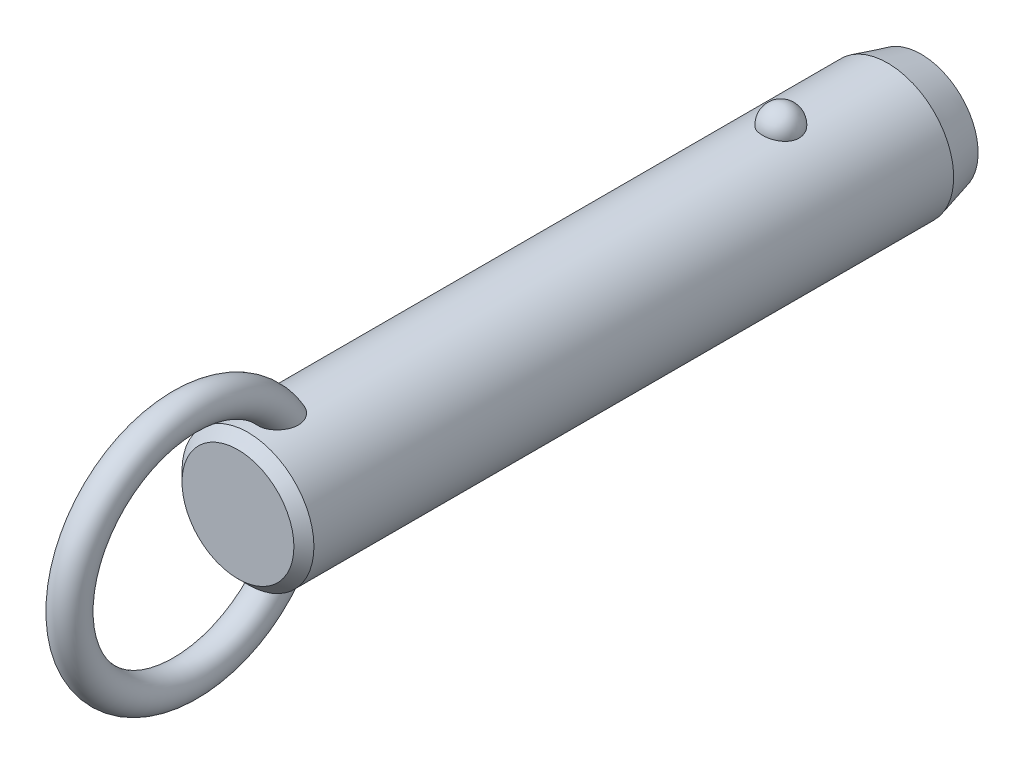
ISO-10303-21;
HEADER;
FILE_DESCRIPTION(('STEP AP214'),'2;1');
FILE_NAME('part.step','',(''),(''),'','','');
FILE_SCHEMA(('AUTOMOTIVE_DESIGN { 1 0 10303 214 1 1 1 1 }'));
ENDSEC;
DATA;
#1=APPLICATION_CONTEXT('core data for automotive mechanical design processes');
#2=APPLICATION_PROTOCOL_DEFINITION('international standard','automotive_design',2000,#1);
#3=PRODUCT_CONTEXT('',#1,'mechanical');
#4=PRODUCT('Part','Part','',(#3));
#5=PRODUCT_RELATED_PRODUCT_CATEGORY('part','',(#4));
#6=PRODUCT_DEFINITION_FORMATION('','',#4);
#7=PRODUCT_DEFINITION_CONTEXT('part definition',#1,'design');
#8=PRODUCT_DEFINITION('design','',#6,#7);
#9=PRODUCT_DEFINITION_SHAPE('','',#8);
#10=(LENGTH_UNIT() NAMED_UNIT(*) SI_UNIT(.MILLI.,.METRE.));
#11=(NAMED_UNIT(*) PLANE_ANGLE_UNIT() SI_UNIT($,.RADIAN.));
#12=(NAMED_UNIT(*) SI_UNIT($,.STERADIAN.) SOLID_ANGLE_UNIT());
#13=UNCERTAINTY_MEASURE_WITH_UNIT(LENGTH_MEASURE(1.E-05),#10,'distance_accuracy_value','');
#14=(GEOMETRIC_REPRESENTATION_CONTEXT(3) GLOBAL_UNCERTAINTY_ASSIGNED_CONTEXT((#13)) GLOBAL_UNIT_ASSIGNED_CONTEXT((#10,
#11,#12)) REPRESENTATION_CONTEXT('',''));
#15=CARTESIAN_POINT('',(0.,0.,0.));
#16=DIRECTION('',(0.,0.,1.));
#17=DIRECTION('',(1.,0.,0.));
#18=AXIS2_PLACEMENT_3D('',#15,#16,#17);
#19=CARTESIAN_POINT('',(0.,0.,53.3));
#20=DIRECTION('',(0.,0.,-1.));
#21=DIRECTION('',(-1.,0.,0.));
#22=AXIS2_PLACEMENT_3D('',#19,#20,#21);
#23=CYLINDRICAL_SURFACE('',#22,7.9);
#24=CARTESIAN_POINT('',(2.1785689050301,7.59367088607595,-2.2));
#25=CARTESIAN_POINT('',(2.17856679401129,7.59367269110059,-2.07701843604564));
#26=CARTESIAN_POINT('',(2.16853481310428,7.59657145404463,-1.95401006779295));
#27=CARTESIAN_POINT('',(2.12864689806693,7.607843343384,-1.71147811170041));
#28=CARTESIAN_POINT('',(2.09878338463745,7.61621856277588,-1.59195587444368));
#29=CARTESIAN_POINT('',(2.0199931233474,7.63749180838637,-1.35985638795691));
#30=CARTESIAN_POINT('',(1.97107475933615,7.6503878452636,-1.24727610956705));
#31=CARTESIAN_POINT('',(1.85539377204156,7.67926115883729,-1.03213234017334));
#32=CARTESIAN_POINT('',(1.78863158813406,7.69523835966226,-0.9295686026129));
#33=CARTESIAN_POINT('',(1.63856494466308,7.7285848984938,-0.736786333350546));
#34=CARTESIAN_POINT('',(1.55518140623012,7.7459606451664,-0.646630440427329));
#35=CARTESIAN_POINT('',(1.37422937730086,7.78009978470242,-0.481747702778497));
#36=CARTESIAN_POINT('',(1.27666086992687,7.79686317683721,-0.4070208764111));
#37=CARTESIAN_POINT('',(1.07024728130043,7.82786153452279,-0.275278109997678));
#38=CARTESIAN_POINT('',(0.961434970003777,7.84210353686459,-0.218212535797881));
#39=CARTESIAN_POINT('',(0.735351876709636,7.86652194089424,-0.123146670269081));
#40=CARTESIAN_POINT('',(0.618082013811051,7.87669878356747,-0.0851443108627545));
#41=CARTESIAN_POINT('',(0.380637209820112,7.89170521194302,-0.0298158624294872));
#42=CARTESIAN_POINT('',(0.260550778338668,7.89662650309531,-0.0121347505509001));
#43=CARTESIAN_POINT('',(0.0190117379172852,7.90090003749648,0.00324379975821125));
#44=CARTESIAN_POINT('',(-0.102440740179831,7.90025280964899,0.000943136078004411));
#45=CARTESIAN_POINT('',(-0.341452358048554,7.89351056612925,-0.0233955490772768));
#46=CARTESIAN_POINT('',(-0.459042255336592,7.88749257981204,-0.0451545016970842));
#47=CARTESIAN_POINT('',(-0.688796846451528,7.87075812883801,-0.107408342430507));
#48=CARTESIAN_POINT('',(-0.800961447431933,7.86004158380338,-0.147903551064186));
#49=CARTESIAN_POINT('',(-1.01743634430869,7.83497131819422,-0.246799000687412));
#50=CARTESIAN_POINT('',(-1.12169791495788,7.82059709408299,-0.305300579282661));
#51=CARTESIAN_POINT('',(-1.31891765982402,7.78976470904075,-0.438549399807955));
#52=CARTESIAN_POINT('',(-1.41187469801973,7.77330633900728,-0.513298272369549));
#53=CARTESIAN_POINT('',(-1.58577142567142,7.73972434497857,-0.678622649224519));
#54=CARTESIAN_POINT('',(-1.66645140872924,7.72259402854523,-0.769470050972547));
#55=CARTESIAN_POINT('',(-1.81161503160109,7.68983776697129,-0.963538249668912));
#56=CARTESIAN_POINT('',(-1.87609753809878,7.6742119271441,-1.06675991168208));
#57=CARTESIAN_POINT('',(-1.98790138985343,7.6460202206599,-1.28401170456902));
#58=CARTESIAN_POINT('',(-2.03501994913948,7.63349104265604,-1.39815107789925));
#59=CARTESIAN_POINT('',(-2.10986724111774,7.6131449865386,-1.63301784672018));
#60=CARTESIAN_POINT('',(-2.1375965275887,7.60532797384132,-1.75374505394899));
#61=CARTESIAN_POINT('',(-2.17289256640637,7.5953195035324,-1.99782562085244));
#62=CARTESIAN_POINT('',(-2.18054294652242,7.59310471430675,-2.12116592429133));
#63=CARTESIAN_POINT('',(-2.17572919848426,7.59448538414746,-2.36741799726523));
#64=CARTESIAN_POINT('',(-2.1632656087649,7.59808068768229,-2.49032977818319));
#65=CARTESIAN_POINT('',(-2.11865035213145,7.61064035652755,-2.73161015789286));
#66=CARTESIAN_POINT('',(-2.08659579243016,7.61957823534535,-2.84999812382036));
#67=CARTESIAN_POINT('',(-2.00367799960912,7.64179982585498,-3.07955956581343));
#68=CARTESIAN_POINT('',(-1.9528140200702,7.65508371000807,-3.19073275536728));
#69=CARTESIAN_POINT('',(-1.83321113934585,7.68460381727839,-3.40337899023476));
#70=CARTESIAN_POINT('',(-1.76437735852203,7.70085556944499,-3.50479651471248));
#71=CARTESIAN_POINT('',(-1.61069526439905,7.73445734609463,-3.69446912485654));
#72=CARTESIAN_POINT('',(-1.52584634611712,7.75180741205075,-3.78272371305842));
#73=CARTESIAN_POINT('',(-1.34198059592,7.78574608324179,-3.94393987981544));
#74=CARTESIAN_POINT('',(-1.24291308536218,7.80233167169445,-4.01684434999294));
#75=CARTESIAN_POINT('',(-1.03352039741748,7.83281625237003,-4.14489386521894));
#76=CARTESIAN_POINT('',(-0.92319600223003,7.84671543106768,-4.20004014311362));
#77=CARTESIAN_POINT('',(-0.695822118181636,7.87011575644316,-4.29042017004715));
#78=CARTESIAN_POINT('',(-0.578872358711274,7.87966903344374,-4.32589112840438));
#79=CARTESIAN_POINT('',(-0.340410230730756,7.8935652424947,-4.37692226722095));
#80=CARTESIAN_POINT('',(-0.218898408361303,7.89790879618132,-4.39248482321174));
#81=CARTESIAN_POINT('',(0.0228107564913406,7.90087453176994,-4.40314405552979));
#82=CARTESIAN_POINT('',(0.142990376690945,7.89960185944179,-4.39861683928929));
#83=CARTESIAN_POINT('',(0.380829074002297,7.89171262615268,-4.37008293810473));
#84=CARTESIAN_POINT('',(0.498488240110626,7.8850962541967,-4.34607694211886));
#85=CARTESIAN_POINT('',(0.727535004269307,7.86726442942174,-4.27939317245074));
#86=CARTESIAN_POINT('',(0.838944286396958,7.85606616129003,-4.23678512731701));
#87=CARTESIAN_POINT('',(1.05295421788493,7.83025654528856,-4.13408348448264));
#88=CARTESIAN_POINT('',(1.15555431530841,7.81564498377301,-4.07398879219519));
#89=CARTESIAN_POINT('',(1.35076763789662,7.7843022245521,-3.93687432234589));
#90=CARTESIAN_POINT('',(1.4432046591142,7.76754209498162,-3.85961036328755));
#91=CARTESIAN_POINT('',(1.6139111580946,7.73387857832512,-3.69076949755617));
#92=CARTESIAN_POINT('',(1.6921781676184,7.71697516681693,-3.59919010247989));
#93=CARTESIAN_POINT('',(1.83380875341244,7.6845643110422,-3.40247278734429));
#94=CARTESIAN_POINT('',(1.89689280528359,7.66908588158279,-3.29712873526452));
#95=CARTESIAN_POINT('',(2.0047823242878,7.64159441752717,-3.07707931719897));
#96=CARTESIAN_POINT('',(2.0495945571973,7.62958010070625,-2.96237743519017));
#97=CARTESIAN_POINT('',(2.11580183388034,7.61146617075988,-2.74040519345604));
#98=CARTESIAN_POINT('',(2.13929812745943,7.60484503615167,-2.63379846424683));
#99=CARTESIAN_POINT('',(2.17068242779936,7.59594664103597,-2.41813481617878));
#100=CARTESIAN_POINT('',(2.17857077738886,7.59366928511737,-2.30907795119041));
#101=CARTESIAN_POINT('',(2.1785689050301,7.59367088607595,-2.2));
#102=B_SPLINE_CURVE_WITH_KNOTS('',3,(#24,#25,#26,#27,#28,#29,#30,#31,#32,#33,#34,#35,#36,#37,
#38,#39,#40,#41,#42,#43,#44,#45,#46,#47,#48,#49,#50,#51,#52,#53,#54,#55,#56,#57,#58,#59,#60,#61,
#62,#63,#64,#65,#66,#67,#68,#69,#70,#71,#72,#73,#74,#75,#76,#77,#78,#79,#80,#81,#82,#83,#84,#85,
#86,#87,#88,#89,#90,#91,#92,#93,#94,#95,#96,#97,#98,#99,#100,#101),.UNSPECIFIED.,.T.,.F.,(4,2,2,
2,2,2,2,2,2,2,2,2,2,2,2,2,2,2,2,2,2,2,2,2,2,2,2,2,2,2,2,2,2,2,2,2,2,2,4),(0.,0.368552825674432,
0.737246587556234,1.10577831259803,1.4743009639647,1.8446206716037,2.21494081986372,
2.5842105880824,2.95344028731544,3.31611630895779,3.67875788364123,4.03628044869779,
4.39380913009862,4.75338791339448,5.11300280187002,5.47939989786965,5.8458226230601,
6.21639834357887,6.58696347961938,6.95598276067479,7.32499216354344,7.69218715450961,
8.0593967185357,8.42858578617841,8.79778880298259,9.16834203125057,9.5388695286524,
9.90482699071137,10.2707407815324,10.6298333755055,10.9889132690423,11.3466585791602,
11.7044262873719,12.0676511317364,12.4309391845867,12.8004764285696,13.1698767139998,
13.4967701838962,13.8236564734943),.UNSPECIFIED.);
#103=CARTESIAN_POINT('',(2.1785689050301,7.59367088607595,-2.2));
#104=VERTEX_POINT('',#103);
#105=EDGE_CURVE('E41',#104,#104,#102,.T.);
#106=ORIENTED_EDGE('',*,*,#105,.T.);
#107=EDGE_LOOP('',(#106));
#108=FACE_BOUND('',#107,.T.);
#109=CARTESIAN_POINT('',(0.,0.,61.62));
#110=DIRECTION('',(0.,0.,1.));
#111=DIRECTION('',(1.,0.,0.));
#112=AXIS2_PLACEMENT_3D('',#109,#110,#111);
#113=CIRCLE('',#112,7.9);
#114=CARTESIAN_POINT('',(7.9,0.,61.62));
#115=VERTEX_POINT('',#114);
#116=EDGE_CURVE('E10',#115,#115,#113,.F.);
#117=ORIENTED_EDGE('',*,*,#116,.T.);
#118=EDGE_LOOP('',(#117));
#119=FACE_BOUND('',#118,.T.);
#120=CARTESIAN_POINT('',(-0.630969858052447,-7.87476203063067,55.5124322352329));
#121=CARTESIAN_POINT('',(-0.734180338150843,-7.8664899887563,55.547285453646));
#122=CARTESIAN_POINT('',(-0.834476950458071,-7.85639291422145,55.5908160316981));
#123=CARTESIAN_POINT('',(-1.0262035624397,-7.83366343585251,55.6940948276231));
#124=CARTESIAN_POINT('',(-1.1176141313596,-7.82102565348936,55.7538775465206));
#125=CARTESIAN_POINT('',(-1.28877277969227,-7.79464922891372,55.8878390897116));
#126=CARTESIAN_POINT('',(-1.36854014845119,-7.78091246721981,55.961993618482));
#127=CARTESIAN_POINT('',(-1.51461521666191,-7.75380398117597,56.1224941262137));
#128=CARTESIAN_POINT('',(-1.58092966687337,-7.74043207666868,56.2088339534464));
#129=CARTESIAN_POINT('',(-1.70019064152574,-7.71512522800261,56.3929784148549));
#130=CARTESIAN_POINT('',(-1.75284037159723,-7.70322473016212,56.4909792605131));
#131=CARTESIAN_POINT('',(-1.84263464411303,-7.68224112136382,56.6941029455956));
#132=CARTESIAN_POINT('',(-1.87977299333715,-7.6731591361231,56.7992286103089));
#133=CARTESIAN_POINT('',(-1.94152728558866,-7.65777930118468,57.0232849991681));
#134=CARTESIAN_POINT('',(-1.96475471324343,-7.65179654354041,57.1426167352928));
#135=CARTESIAN_POINT('',(-1.99449499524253,-7.64409642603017,57.3834298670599));
#136=CARTESIAN_POINT('',(-2.0010005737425,-7.64238092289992,57.5049121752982));
#137=CARTESIAN_POINT('',(-1.99856014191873,-7.64302120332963,57.7683409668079));
#138=CARTESIAN_POINT('',(-1.98680021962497,-7.64611845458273,57.9102565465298));
#139=CARTESIAN_POINT('',(-1.94457772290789,-7.65696186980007,58.1911188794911));
#140=CARTESIAN_POINT('',(-1.91409393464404,-7.66471330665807,58.3300620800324));
#141=CARTESIAN_POINT('',(-1.82768670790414,-7.68582947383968,58.631939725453));
#142=CARTESIAN_POINT('',(-1.76772963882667,-7.70003779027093,58.793686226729));
#143=CARTESIAN_POINT('',(-1.65998501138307,-7.72371550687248,59.0276956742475));
#144=CARTESIAN_POINT('',(-1.621079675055,-7.73200670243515,59.1042974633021));
#145=CARTESIAN_POINT('',(-1.53727726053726,-7.74910377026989,59.2540798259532));
#146=CARTESIAN_POINT('',(-1.49238215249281,-7.75790947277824,59.3272615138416));
#147=CARTESIAN_POINT('',(-1.37397050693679,-7.77993338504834,59.5028838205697));
#148=CARTESIAN_POINT('',(-1.29690364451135,-7.79328473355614,59.6029557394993));
#149=CARTESIAN_POINT('',(-1.12885487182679,-7.81939266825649,59.7907147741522));
#150=CARTESIAN_POINT('',(-1.03789926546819,-7.83215032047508,59.8784247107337));
#151=CARTESIAN_POINT('',(-0.869532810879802,-7.85231710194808,60.0134148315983));
#152=CARTESIAN_POINT('',(-0.795716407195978,-7.86021093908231,60.065076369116));
#153=CARTESIAN_POINT('',(-0.640813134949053,-7.87434920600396,60.1563815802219));
#154=CARTESIAN_POINT('',(-0.559737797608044,-7.88059619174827,60.1960438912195));
#155=CARTESIAN_POINT('',(-0.406456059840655,-7.88984116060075,60.2543008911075));
#156=CARTESIAN_POINT('',(-0.335227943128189,-7.89321892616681,60.2753848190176));
#157=CARTESIAN_POINT('',(-0.19019307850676,-7.89804235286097,60.3054141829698));
#158=CARTESIAN_POINT('',(-0.11638863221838,-7.89948969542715,60.3143701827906));
#159=CARTESIAN_POINT('',(0.0318414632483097,-7.90028409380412,60.3192915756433));
#160=CARTESIAN_POINT('',(0.106268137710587,-7.89962640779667,60.3152276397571));
#161=CARTESIAN_POINT('',(0.25329066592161,-7.8962818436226,60.2944615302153));
#162=CARTESIAN_POINT('',(0.325885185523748,-7.8935935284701,60.2777504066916));
#163=CARTESIAN_POINT('',(0.481441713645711,-7.88577340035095,60.2287380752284));
#164=CARTESIAN_POINT('',(0.563611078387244,-7.88026321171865,60.194005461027));
#165=CARTESIAN_POINT('',(0.721129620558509,-7.86741729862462,60.1117965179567));
#166=CARTESIAN_POINT('',(0.796466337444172,-7.86007832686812,60.0642975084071));
#167=CARTESIAN_POINT('',(0.971456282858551,-7.84073285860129,59.936513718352));
#168=CARTESIAN_POINT('',(1.06719686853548,-7.82809461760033,59.8510047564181));
#169=CARTESIAN_POINT('',(1.24418921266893,-7.80192439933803,59.666232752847));
#170=CARTESIAN_POINT('',(1.32540832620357,-7.78839049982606,59.5669395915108));
#171=CARTESIAN_POINT('',(1.45199971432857,-7.76559693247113,59.3895760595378));
#172=CARTESIAN_POINT('',(1.5008564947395,-7.75626094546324,59.3139542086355));
#173=CARTESIAN_POINT('',(1.59197749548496,-7.7380727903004,59.1587428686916));
#174=CARTESIAN_POINT('',(1.63423919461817,-7.72922080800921,59.0791518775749));
#175=CARTESIAN_POINT('',(1.71222612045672,-7.71231959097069,58.9166640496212));
#176=CARTESIAN_POINT('',(1.74794516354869,-7.70427111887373,58.833764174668));
#177=CARTESIAN_POINT('',(1.81270113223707,-7.68929240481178,58.6652967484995));
#178=CARTESIAN_POINT('',(1.84173789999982,-7.68236218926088,58.5797291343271));
#179=CARTESIAN_POINT('',(1.89322698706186,-7.6698375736,58.4052870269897));
#180=CARTESIAN_POINT('',(1.91558744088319,-7.66426199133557,58.3163838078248));
#181=CARTESIAN_POINT('',(1.95281367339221,-7.65485915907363,58.1369696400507));
#182=CARTESIAN_POINT('',(1.96767946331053,-7.65103190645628,58.0464586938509));
#183=CARTESIAN_POINT('',(2.00021456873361,-7.64262981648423,57.7737320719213));
#184=CARTESIAN_POINT('',(2.00600691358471,-7.6410871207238,57.5897099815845));
#185=CARTESIAN_POINT('',(1.98445334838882,-7.64669564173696,57.2765019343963));
#186=CARTESIAN_POINT('',(1.96607186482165,-7.65149688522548,57.146618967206));
#187=CARTESIAN_POINT('',(1.90884967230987,-7.6659762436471,56.8916321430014));
#188=CARTESIAN_POINT('',(1.87002101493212,-7.67565148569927,56.766525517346));
#189=CARTESIAN_POINT('',(1.77063986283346,-7.69918471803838,56.5245401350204));
#190=CARTESIAN_POINT('',(1.70993724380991,-7.71307150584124,56.4077250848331));
#191=CARTESIAN_POINT('',(1.56733070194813,-7.74330306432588,56.1881444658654));
#192=CARTESIAN_POINT('',(1.48543692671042,-7.75964665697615,56.0853722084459));
#193=CARTESIAN_POINT('',(1.31346177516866,-7.79047523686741,55.9093800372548));
#194=CARTESIAN_POINT('',(1.22547278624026,-7.80495298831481,55.8341066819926));
#195=CARTESIAN_POINT('',(1.0372435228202,-7.83218597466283,55.7004864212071));
#196=CARTESIAN_POINT('',(0.937008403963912,-7.84494192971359,55.6421324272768));
#197=CARTESIAN_POINT('',(0.733599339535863,-7.86649045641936,55.5470270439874));
#198=CARTESIAN_POINT('',(0.630941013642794,-7.87547134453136,55.5092109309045));
#199=CARTESIAN_POINT('',(0.420465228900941,-7.88950708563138,55.4511160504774));
#200=CARTESIAN_POINT('',(0.312645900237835,-7.89456050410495,55.4308436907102));
#201=CARTESIAN_POINT('',(0.0960869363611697,-7.9001518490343,55.4084559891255));
#202=CARTESIAN_POINT('',(-0.0126341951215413,-7.90073226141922,55.4061698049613));
#203=CARTESIAN_POINT('',(-0.228766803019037,-7.89742350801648,55.4193678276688));
#204=CARTESIAN_POINT('',(-0.336180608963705,-7.89354403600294,55.4348134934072));
#205=CARTESIAN_POINT('',(-0.473410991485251,-7.88586871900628,55.4662177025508));
#206=CARTESIAN_POINT('',(-0.505257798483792,-7.88388984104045,55.4743541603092));
#207=CARTESIAN_POINT('',(-0.568481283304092,-7.87958326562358,55.4922083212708));
#208=CARTESIAN_POINT('',(-0.599857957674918,-7.87725556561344,55.5019260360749));
#209=CARTESIAN_POINT('',(-0.630969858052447,-7.87476203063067,55.5124322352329));
#210=B_SPLINE_CURVE_WITH_KNOTS('',3,(#120,#121,#122,#123,#124,#125,#126,#127,#128,#129,#130,
#131,#132,#133,#134,#135,#136,#137,#138,#139,#140,#141,#142,#143,#144,#145,#146,#147,#148,#149,
#150,#151,#152,#153,#154,#155,#156,#157,#158,#159,#160,#161,#162,#163,#164,#165,#166,#167,#168,
#169,#170,#171,#172,#173,#174,#175,#176,#177,#178,#179,#180,#181,#182,#183,#184,#185,#186,#187,
#188,#189,#190,#191,#192,#193,#194,#195,#196,#197,#198,#199,#200,#201,#202,#203,#204,#205,#206,
#207,#208,#209),.UNSPECIFIED.,.T.,.F.,(4,2,2,2,2,2,2,2,2,2,2,2,2,2,2,2,2,2,2,2,2,2,2,2,2,2,2,2,
2,2,2,2,2,2,2,2,2,2,2,2,2,2,2,2,4),(0.,0.327622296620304,0.655945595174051,0.983718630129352,
1.3113267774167,1.64554655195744,1.97989964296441,2.34365728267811,2.70757317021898,
3.13333684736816,3.55958380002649,4.07655306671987,4.3352789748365,4.593919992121,
4.9738243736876,5.35301797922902,5.62348245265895,5.89352465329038,6.11565959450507,
6.3376009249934,6.56004255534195,6.782641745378,7.04930844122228,7.31645206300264,
7.70130871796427,8.08701995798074,8.35824509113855,8.62957365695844,8.90115735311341,
9.17274746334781,9.44791855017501,9.72308922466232,10.2715298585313,10.6638393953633,
11.0559179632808,11.4507403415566,11.8453740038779,12.1936425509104,12.5417649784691,
12.8695063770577,13.1973674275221,13.5221104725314,13.8461490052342,13.9449071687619,
14.0436660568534),.UNSPECIFIED.);
#211=CARTESIAN_POINT('',(-0.630969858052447,-7.87476203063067,55.5124322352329));
#212=VERTEX_POINT('',#211);
#213=EDGE_CURVE('E59',#212,#212,#210,.T.);
#214=ORIENTED_EDGE('',*,*,#213,.T.);
#215=EDGE_LOOP('',(#214));
#216=FACE_BOUND('',#215,.T.);
#217=CARTESIAN_POINT('',(-0.630969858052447,7.87476203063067,55.5124322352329));
#218=CARTESIAN_POINT('',(-0.528918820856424,7.88293636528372,55.4779798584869));
#219=CARTESIAN_POINT('',(-0.423745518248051,7.8893481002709,55.451915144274));
#220=CARTESIAN_POINT('',(-0.210236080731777,7.8979273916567,55.4172825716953));
#221=CARTESIAN_POINT('',(-0.101893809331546,7.90008607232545,55.4087513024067));
#222=CARTESIAN_POINT('',(0.114660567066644,7.89990877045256,55.4094570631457));
#223=CARTESIAN_POINT('',(0.222872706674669,7.89757640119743,55.4186798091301));
#224=CARTESIAN_POINT('',(0.436107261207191,7.88867538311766,55.4546525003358));
#225=CARTESIAN_POINT('',(0.541131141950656,7.8821087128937,55.4813942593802));
#226=CARTESIAN_POINT('',(0.745085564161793,7.86545130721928,55.5517561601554));
#227=CARTESIAN_POINT('',(0.844015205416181,7.85536005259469,55.5953787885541));
#228=CARTESIAN_POINT('',(1.03299167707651,7.83275153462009,55.6983796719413));
#229=CARTESIAN_POINT('',(1.12303841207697,7.8202342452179,55.7577580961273));
#230=CARTESIAN_POINT('',(1.29214734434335,7.79408219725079,55.8908647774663));
#231=CARTESIAN_POINT('',(1.37116907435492,7.78044359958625,55.9646436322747));
#232=CARTESIAN_POINT('',(1.51597677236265,7.75353170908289,56.1242353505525));
#233=CARTESIAN_POINT('',(1.58176261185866,7.74025841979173,56.2100483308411));
#234=CARTESIAN_POINT('',(1.70057386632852,7.71504069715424,56.393644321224));
#235=CARTESIAN_POINT('',(1.75320073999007,7.7031425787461,56.4916906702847));
#236=CARTESIAN_POINT('',(1.8429376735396,7.68216822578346,56.6948931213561));
#237=CARTESIAN_POINT('',(1.88004278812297,7.67309289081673,56.8000514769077));
#238=CARTESIAN_POINT('',(1.9417232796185,7.6577294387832,57.0241671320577));
#239=CARTESIAN_POINT('',(1.96491037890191,7.65175648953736,57.1435248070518));
#240=CARTESIAN_POINT('',(1.9945689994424,7.64407702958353,57.3843848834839));
#241=CARTESIAN_POINT('',(2.00103304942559,7.64237242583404,57.5058882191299));
#242=CARTESIAN_POINT('',(1.99850166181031,7.64303650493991,57.7693688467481));
#243=CARTESIAN_POINT('',(1.98669038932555,7.64614714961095,57.9113141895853));
#244=CARTESIAN_POINT('',(1.94436120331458,7.6570170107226,58.1922287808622));
#245=CARTESIAN_POINT('',(1.91382203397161,7.66478150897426,58.3311944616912));
#246=CARTESIAN_POINT('',(1.82728754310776,7.68592483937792,58.6331110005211));
#247=CARTESIAN_POINT('',(1.76725778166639,7.7001468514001,58.7948721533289));
#248=CARTESIAN_POINT('',(1.65939700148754,7.72384204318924,59.0288914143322));
#249=CARTESIAN_POINT('',(1.62045187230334,7.73213852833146,59.1054942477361));
#250=CARTESIAN_POINT('',(1.53656684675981,7.74924489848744,59.2552737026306));
#251=CARTESIAN_POINT('',(1.49162892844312,7.75805461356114,59.3284514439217));
#252=CARTESIAN_POINT('',(1.37317698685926,7.78007342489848,59.5039520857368));
#253=CARTESIAN_POINT('',(1.29612360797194,7.79341423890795,59.6039112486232));
#254=CARTESIAN_POINT('',(1.12812043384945,7.81949839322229,59.7914508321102));
#255=CARTESIAN_POINT('',(1.03719688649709,7.83224280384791,59.8790540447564));
#256=CARTESIAN_POINT('',(0.868871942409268,7.85239026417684,60.0138971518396));
#257=CARTESIAN_POINT('',(0.795056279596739,7.86027769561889,60.0655113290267));
#258=CARTESIAN_POINT('',(0.64016072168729,7.87440222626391,60.1567201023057));
#259=CARTESIAN_POINT('',(0.559092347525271,7.88064188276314,60.1963333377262));
#260=CARTESIAN_POINT('',(0.405820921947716,7.8898738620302,60.2545056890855));
#261=CARTESIAN_POINT('',(0.334594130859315,7.89324577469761,60.2755523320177));
#262=CARTESIAN_POINT('',(0.189568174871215,7.89805733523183,60.3055070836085));
#263=CARTESIAN_POINT('',(0.115771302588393,7.89949866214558,60.3144257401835));
#264=CARTESIAN_POINT('',(-0.0324359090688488,7.90028156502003,60.3192758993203));
#265=CARTESIAN_POINT('',(-0.106847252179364,7.89961843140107,60.3151782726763));
#266=CARTESIAN_POINT('',(-0.253834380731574,7.8962642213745,60.2943519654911));
#267=CARTESIAN_POINT('',(-0.32640882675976,7.89357170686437,60.2776143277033));
#268=CARTESIAN_POINT('',(-0.481962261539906,7.88574179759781,60.2285391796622));
#269=CARTESIAN_POINT('',(-0.564145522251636,7.88022507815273,60.1937638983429));
#270=CARTESIAN_POINT('',(-0.721685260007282,7.8673664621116,60.1114686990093));
#271=CARTESIAN_POINT('',(-0.797029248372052,7.8600213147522,60.0639260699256));
#272=CARTESIAN_POINT('',(-0.97204426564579,7.84066026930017,59.9360267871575));
#273=CARTESIAN_POINT('',(-1.06779803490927,7.82801274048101,59.8504436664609));
#274=CARTESIAN_POINT('',(-1.24480531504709,7.80182621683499,59.6655223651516));
#275=CARTESIAN_POINT('',(-1.3260261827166,7.78828530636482,59.5661540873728));
#276=CARTESIAN_POINT('',(-1.45259834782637,7.76548487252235,59.3886806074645));
#277=CARTESIAN_POINT('',(-1.50143856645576,7.75614818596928,59.3130252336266));
#278=CARTESIAN_POINT('',(-1.59252410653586,7.73796020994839,59.1577484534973));
#279=CARTESIAN_POINT('',(-1.63476690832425,7.72910910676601,59.0781255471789));
#280=CARTESIAN_POINT('',(-1.71271318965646,7.71221133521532,58.9155750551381));
#281=CARTESIAN_POINT('',(-1.74841047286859,7.70416543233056,58.8326444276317));
#282=CARTESIAN_POINT('',(-1.81311929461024,7.6891937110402,58.6641168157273));
#283=CARTESIAN_POINT('',(-1.84213067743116,7.6822679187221,58.5785197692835));
#284=CARTESIAN_POINT('',(-1.89356259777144,7.66975461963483,58.4040254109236));
#285=CARTESIAN_POINT('',(-1.91589165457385,7.66418586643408,58.3150995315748));
#286=CARTESIAN_POINT('',(-1.95305070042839,7.65479859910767,58.1356424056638));
#287=CARTESIAN_POINT('',(-1.96788069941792,7.65098008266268,58.0451111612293));
#288=CARTESIAN_POINT('',(-2.00030078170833,7.64260704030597,57.7723270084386));
#289=CARTESIAN_POINT('',(-2.00600576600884,7.64108760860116,57.5882718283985));
#290=CARTESIAN_POINT('',(-1.98428483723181,7.64673945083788,57.2750800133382));
#291=CARTESIAN_POINT('',(-1.96583698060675,7.6515575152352,57.1452400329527));
#292=CARTESIAN_POINT('',(-1.90848948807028,7.66606613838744,56.8903619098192));
#293=CARTESIAN_POINT('',(-1.86960376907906,7.67575338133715,56.765320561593));
#294=CARTESIAN_POINT('',(-1.7701342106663,7.6993013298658,56.5235009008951));
#295=CARTESIAN_POINT('',(-1.70940488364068,7.71318991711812,56.4067844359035));
#296=CARTESIAN_POINT('',(-1.56672953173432,7.74342495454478,56.1873404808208));
#297=CARTESIAN_POINT('',(-1.48478316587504,7.75977144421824,56.0846132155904));
#298=CARTESIAN_POINT('',(-1.31266325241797,7.79061163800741,55.908643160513));
#299=CARTESIAN_POINT('',(-1.22456383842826,7.80509908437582,55.8333589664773));
#300=CARTESIAN_POINT('',(-1.03622400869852,7.83231881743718,55.6998659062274));
#301=CARTESIAN_POINT('',(-0.936015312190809,7.84505551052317,55.6416137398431));
#302=CARTESIAN_POINT('',(-0.798824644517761,7.85957802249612,55.5775408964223));
#303=CARTESIAN_POINT('',(-0.765787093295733,7.86286821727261,55.5632248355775));
#304=CARTESIAN_POINT('',(-0.698939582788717,7.86909211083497,55.536436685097));
#305=CARTESIAN_POINT('',(-0.665129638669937,7.8720258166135,55.5239645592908));
#306=CARTESIAN_POINT('',(-0.630969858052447,7.87476203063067,55.5124322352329));
#307=B_SPLINE_CURVE_WITH_KNOTS('',3,(#217,#218,#219,#220,#221,#222,#223,#224,#225,#226,#227,
#228,#229,#230,#231,#232,#233,#234,#235,#236,#237,#238,#239,#240,#241,#242,#243,#244,#245,#246,
#247,#248,#249,#250,#251,#252,#253,#254,#255,#256,#257,#258,#259,#260,#261,#262,#263,#264,#265,
#266,#267,#268,#269,#270,#271,#272,#273,#274,#275,#276,#277,#278,#279,#280,#281,#282,#283,#284,
#285,#286,#287,#288,#289,#290,#291,#292,#293,#294,#295,#296,#297,#298,#299,#300,#301,#302,#303,
#304,#305,#306),.UNSPECIFIED.,.T.,.F.,(4,2,2,2,2,2,2,2,2,2,2,2,2,2,2,2,2,2,2,2,2,2,2,2,2,2,2,2,
2,2,2,2,2,2,2,2,2,2,2,2,2,2,2,2,4),(0.,0.323920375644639,0.648516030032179,0.972850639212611,
1.29703380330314,1.62126473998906,1.94549915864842,2.27089401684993,2.59629203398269,
2.93059633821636,3.26500707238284,3.6288164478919,3.99278833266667,4.41865421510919,
4.84500434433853,5.36209210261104,5.62087589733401,5.87957448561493,6.25918598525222,
6.63808782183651,6.90846748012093,7.17842501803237,7.40052350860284,7.62242871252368,
7.84483086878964,8.06739077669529,8.33414615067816,8.60137921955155,8.98641454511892,
9.3723041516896,9.6435867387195,9.91497268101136,10.1866142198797,10.4582620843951,
10.7334745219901,11.0086865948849,11.5572126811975,11.9494246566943,12.3413699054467,
12.7359755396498,13.1305875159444,13.4791770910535,13.82687259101,13.9353013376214,
14.0437279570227),.UNSPECIFIED.);
#308=CARTESIAN_POINT('',(-0.630969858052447,7.87476203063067,55.5124322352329));
#309=VERTEX_POINT('',#308);
#310=EDGE_CURVE('E67',#309,#309,#307,.T.);
#311=ORIENTED_EDGE('',*,*,#310,.T.);
#312=EDGE_LOOP('',(#311));
#313=FACE_BOUND('',#312,.T.);
#314=CARTESIAN_POINT('',(0.,0.,-14.9999999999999));
#315=DIRECTION('',(0.,0.,-1.));
#316=DIRECTION('',(-1.,0.,0.));
#317=AXIS2_PLACEMENT_3D('',#314,#315,#316);
#318=CIRCLE('',#317,7.9);
#319=CARTESIAN_POINT('',(-7.9,0.,-14.9999999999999));
#320=VERTEX_POINT('',#319);
#321=EDGE_CURVE('E56',#320,#320,#318,.F.);
#322=ORIENTED_EDGE('',*,*,#321,.T.);
#323=EDGE_LOOP('',(#322));
#324=FACE_BOUND('',#323,.T.);
#325=ADVANCED_FACE('F37',(#108,#119,#216,#313,#324),#23,.T.);
#326=CARTESIAN_POINT('',(0.,0.,-19.));
#327=DIRECTION('',(0.,0.,-1.));
#328=DIRECTION('',(-1.,0.,0.));
#329=AXIS2_PLACEMENT_3D('',#326,#327,#328);
#330=PLANE('',#329);
#331=CARTESIAN_POINT('',(0.,0.,-19.));
#332=DIRECTION('',(0.,0.,-1.));
#333=DIRECTION('',(-1.,0.,0.));
#334=AXIS2_PLACEMENT_3D('',#331,#332,#333);
#335=CIRCLE('',#334,6.82820323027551);
#336=CARTESIAN_POINT('',(-6.82820323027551,0.,-19.));
#337=VERTEX_POINT('',#336);
#338=EDGE_CURVE('E66',#337,#337,#335,.T.);
#339=ORIENTED_EDGE('',*,*,#338,.T.);
#340=EDGE_LOOP('',(#339));
#341=FACE_BOUND('',#340,.T.);
#342=ADVANCED_FACE('F85',(#341),#330,.T.);
#343=CARTESIAN_POINT('',(0.,0.,-19.));
#344=DIRECTION('',(0.,0.,1.));
#345=DIRECTION('',(1.,0.,0.));
#346=AXIS2_PLACEMENT_3D('',#343,#344,#345);
#347=CONICAL_SURFACE('',#346,6.82820323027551,0.261799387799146);
#348=ORIENTED_EDGE('',*,*,#321,.F.);
#349=EDGE_LOOP('',(#348));
#350=FACE_BOUND('',#349,.T.);
#351=ORIENTED_EDGE('',*,*,#338,.F.);
#352=EDGE_LOOP('',(#351));
#353=FACE_BOUND('',#352,.T.);
#354=ADVANCED_FACE('F83',(#350,#353),#347,.T.);
#355=CARTESIAN_POINT('',(0.,0.,62.82));
#356=DIRECTION('',(0.,0.,1.));
#357=DIRECTION('',(1.,0.,0.));
#358=AXIS2_PLACEMENT_3D('',#355,#356,#357);
#359=PLANE('',#358);
#360=CARTESIAN_POINT('',(0.,0.,62.82));
#361=DIRECTION('',(0.,0.,1.));
#362=DIRECTION('',(1.,0.,0.));
#363=AXIS2_PLACEMENT_3D('',#360,#361,#362);
#364=CIRCLE('',#363,6.70000000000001);
#365=CARTESIAN_POINT('',(6.70000000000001,0.,62.82));
#366=VERTEX_POINT('',#365);
#367=EDGE_CURVE('E50',#366,#366,#364,.T.);
#368=ORIENTED_EDGE('',*,*,#367,.T.);
#369=EDGE_LOOP('',(#368));
#370=FACE_BOUND('',#369,.T.);
#371=ADVANCED_FACE('F77',(#370),#359,.T.);
#372=CARTESIAN_POINT('',(0.,0.,69.15));
#373=DIRECTION('',(1.,0.,0.));
#374=DIRECTION('',(0.,0.,-1.));
#375=AXIS2_PLACEMENT_3D('',#372,#373,#374);
#376=TOROIDAL_SURFACE('',#375,13.85,2.);
#377=ORIENTED_EDGE('',*,*,#310,.F.);
#378=EDGE_LOOP('',(#377));
#379=FACE_BOUND('',#378,.T.);
#380=ORIENTED_EDGE('',*,*,#213,.F.);
#381=EDGE_LOOP('',(#380));
#382=FACE_BOUND('',#381,.T.);
#383=ADVANCED_FACE('F73',(#379,#382),#376,.T.);
#384=CARTESIAN_POINT('',(0.,0.,62.82));
#385=DIRECTION('',(0.,0.,-1.));
#386=DIRECTION('',(-1.,0.,0.));
#387=AXIS2_PLACEMENT_3D('',#384,#385,#386);
#388=CONICAL_SURFACE('',#387,6.70000000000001,0.785398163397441);
#389=ORIENTED_EDGE('',*,*,#116,.F.);
#390=EDGE_LOOP('',(#389));
#391=FACE_BOUND('',#390,.T.);
#392=ORIENTED_EDGE('',*,*,#367,.F.);
#393=EDGE_LOOP('',(#392));
#394=FACE_BOUND('',#393,.T.);
#395=ADVANCED_FACE('F39',(#391,#394),#388,.T.);
#396=CARTESIAN_POINT('',(0.,7.9,-2.2));
#397=DIRECTION('',(0.,1.,0.));
#398=DIRECTION('',(0.,0.,-1.));
#399=AXIS2_PLACEMENT_3D('',#396,#397,#398);
#400=SPHERICAL_SURFACE('',#399,2.2);
#401=ORIENTED_EDGE('',*,*,#105,.F.);
#402=EDGE_LOOP('',(#401));
#403=FACE_BOUND('',#402,.T.);
#404=ADVANCED_FACE('F79',(#403),#400,.T.);
#405=CLOSED_SHELL('',(#325,#342,#354,#371,#383,#395,#404));
#406=MANIFOLD_SOLID_BREP('B2',#405);
#407=ADVANCED_BREP_SHAPE_REPRESENTATION('',(#18,#406),#14);
#408=SHAPE_DEFINITION_REPRESENTATION(#9,#407);
ENDSEC;
END-ISO-10303-21;
